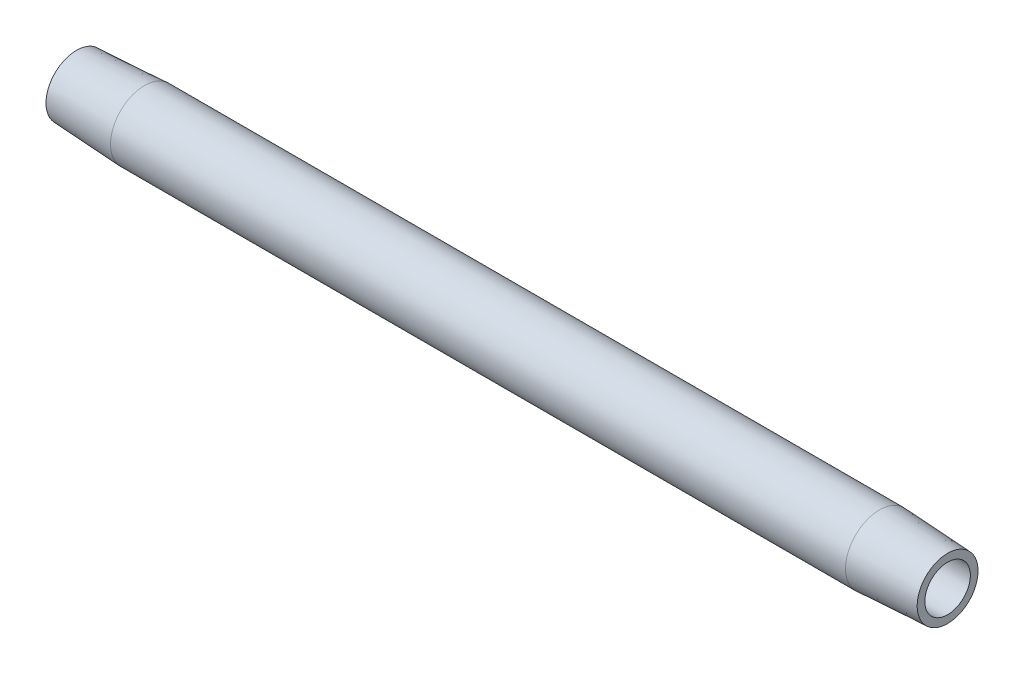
ISO-10303-21;
HEADER;
FILE_DESCRIPTION(('STEP AP214'),'2;1');
FILE_NAME('part.step','',(''),(''),'','','');
FILE_SCHEMA(('AUTOMOTIVE_DESIGN { 1 0 10303 214 1 1 1 1 }'));
ENDSEC;
DATA;
#1=APPLICATION_CONTEXT('core data for automotive mechanical design processes');
#2=APPLICATION_PROTOCOL_DEFINITION('international standard','automotive_design',2000,#1);
#3=PRODUCT_CONTEXT('',#1,'mechanical');
#4=PRODUCT('Part','Part','',(#3));
#5=PRODUCT_RELATED_PRODUCT_CATEGORY('part','',(#4));
#6=PRODUCT_DEFINITION_FORMATION('','',#4);
#7=PRODUCT_DEFINITION_CONTEXT('part definition',#1,'design');
#8=PRODUCT_DEFINITION('design','',#6,#7);
#9=PRODUCT_DEFINITION_SHAPE('','',#8);
#10=(LENGTH_UNIT() NAMED_UNIT(*) SI_UNIT(.MILLI.,.METRE.));
#11=(NAMED_UNIT(*) PLANE_ANGLE_UNIT() SI_UNIT($,.RADIAN.));
#12=(NAMED_UNIT(*) SI_UNIT($,.STERADIAN.) SOLID_ANGLE_UNIT());
#13=UNCERTAINTY_MEASURE_WITH_UNIT(LENGTH_MEASURE(1.E-05),#10,'distance_accuracy_value','');
#14=(GEOMETRIC_REPRESENTATION_CONTEXT(3) GLOBAL_UNCERTAINTY_ASSIGNED_CONTEXT((#13)) GLOBAL_UNIT_ASSIGNED_CONTEXT((#10,
#11,#12)) REPRESENTATION_CONTEXT('',''));
#15=CARTESIAN_POINT('',(0.,0.,0.));
#16=DIRECTION('',(0.,0.,1.));
#17=DIRECTION('',(1.,0.,0.));
#18=AXIS2_PLACEMENT_3D('',#15,#16,#17);
#19=CARTESIAN_POINT('',(0.476141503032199,0.,0.));
#20=DIRECTION('',(-1.,0.,0.));
#21=DIRECTION('',(0.,0.,1.));
#22=AXIS2_PLACEMENT_3D('',#19,#20,#21);
#23=CYLINDRICAL_SURFACE('',#22,3.96875);
#24=CARTESIAN_POINT('',(7.9375,0.,0.));
#25=DIRECTION('',(-1.,0.,0.));
#26=DIRECTION('',(0.,0.,1.));
#27=AXIS2_PLACEMENT_3D('',#24,#25,#26);
#28=CIRCLE('',#27,3.96875);
#29=CARTESIAN_POINT('',(7.9375,0.,3.96875));
#30=VERTEX_POINT('',#29);
#31=EDGE_CURVE('E10',#30,#30,#28,.T.);
#32=ORIENTED_EDGE('',*,*,#31,.F.);
#33=EDGE_LOOP('',(#32));
#34=FACE_BOUND('',#33,.T.);
#35=CARTESIAN_POINT('',(93.6625,0.,0.));
#36=DIRECTION('',(-1.,0.,0.));
#37=DIRECTION('',(0.,0.,1.));
#38=AXIS2_PLACEMENT_3D('',#35,#36,#37);
#39=CIRCLE('',#38,3.96875);
#40=CARTESIAN_POINT('',(93.6625,0.,3.96875));
#41=VERTEX_POINT('',#40);
#42=EDGE_CURVE('E52',#41,#41,#39,.T.);
#43=ORIENTED_EDGE('',*,*,#42,.T.);
#44=EDGE_LOOP('',(#43));
#45=FACE_BOUND('',#44,.T.);
#46=ADVANCED_FACE('F30',(#34,#45),#23,.T.);
#47=CARTESIAN_POINT('',(7.9375,0.,0.));
#48=DIRECTION('',(1.,0.,0.));
#49=DIRECTION('',(0.,0.,-1.));
#50=AXIS2_PLACEMENT_3D('',#47,#48,#49);
#51=CONICAL_SURFACE('',#50,3.96875,0.0523598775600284);
#52=CARTESIAN_POINT('',(0.,0.,0.));
#53=DIRECTION('',(-1.,0.,0.));
#54=DIRECTION('',(0.,0.,1.));
#55=AXIS2_PLACEMENT_3D('',#52,#53,#54);
#56=CIRCLE('',#55,3.55276325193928);
#57=CARTESIAN_POINT('',(0.,0.,3.55276325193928));
#58=VERTEX_POINT('',#57);
#59=EDGE_CURVE('E36',#58,#58,#56,.T.);
#60=ORIENTED_EDGE('',*,*,#59,.F.);
#61=EDGE_LOOP('',(#60));
#62=FACE_BOUND('',#61,.T.);
#63=ORIENTED_EDGE('',*,*,#31,.T.);
#64=EDGE_LOOP('',(#63));
#65=FACE_BOUND('',#64,.T.);
#66=ADVANCED_FACE('F77',(#62,#65),#51,.T.);
#67=CARTESIAN_POINT('',(0.,3.55276325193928,0.));
#68=DIRECTION('',(1.,0.,0.));
#69=DIRECTION('',(0.,0.,-1.));
#70=AXIS2_PLACEMENT_3D('',#67,#68,#69);
#71=PLANE('',#70);
#72=CARTESIAN_POINT('',(0.,0.,0.));
#73=DIRECTION('',(-1.,0.,0.));
#74=DIRECTION('',(0.,0.,1.));
#75=AXIS2_PLACEMENT_3D('',#72,#73,#74);
#76=CIRCLE('',#75,2.65429999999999);
#77=CARTESIAN_POINT('',(0.,0.,2.65429999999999));
#78=VERTEX_POINT('',#77);
#79=EDGE_CURVE('E40',#78,#78,#76,.T.);
#80=ORIENTED_EDGE('',*,*,#79,.F.);
#81=EDGE_LOOP('',(#80));
#82=FACE_BOUND('',#81,.T.);
#83=ORIENTED_EDGE('',*,*,#59,.T.);
#84=EDGE_LOOP('',(#83));
#85=FACE_BOUND('',#84,.T.);
#86=ADVANCED_FACE('F72',(#82,#85),#71,.F.);
#87=CARTESIAN_POINT('',(0.476141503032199,0.,0.));
#88=DIRECTION('',(-1.,0.,0.));
#89=DIRECTION('',(0.,0.,1.));
#90=AXIS2_PLACEMENT_3D('',#87,#88,#89);
#91=CYLINDRICAL_SURFACE('',#90,2.6543);
#92=CARTESIAN_POINT('',(101.6,0.,0.));
#93=DIRECTION('',(-1.,0.,0.));
#94=DIRECTION('',(0.,0.,1.));
#95=AXIS2_PLACEMENT_3D('',#92,#93,#94);
#96=CIRCLE('',#95,2.6543);
#97=CARTESIAN_POINT('',(101.6,0.,2.6543));
#98=VERTEX_POINT('',#97);
#99=EDGE_CURVE('E44',#98,#98,#96,.T.);
#100=ORIENTED_EDGE('',*,*,#99,.F.);
#101=EDGE_LOOP('',(#100));
#102=FACE_BOUND('',#101,.T.);
#103=ORIENTED_EDGE('',*,*,#79,.T.);
#104=EDGE_LOOP('',(#103));
#105=FACE_BOUND('',#104,.T.);
#106=ADVANCED_FACE('F66',(#102,#105),#91,.F.);
#107=CARTESIAN_POINT('',(101.6,2.6543,0.));
#108=DIRECTION('',(-1.,0.,0.));
#109=DIRECTION('',(0.,0.,1.));
#110=AXIS2_PLACEMENT_3D('',#107,#108,#109);
#111=PLANE('',#110);
#112=CARTESIAN_POINT('',(101.6,0.,0.));
#113=DIRECTION('',(-1.,0.,0.));
#114=DIRECTION('',(0.,0.,1.));
#115=AXIS2_PLACEMENT_3D('',#112,#113,#114);
#116=CIRCLE('',#115,3.55276325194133);
#117=CARTESIAN_POINT('',(101.6,0.,3.55276325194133));
#118=VERTEX_POINT('',#117);
#119=EDGE_CURVE('E49',#118,#118,#116,.T.);
#120=ORIENTED_EDGE('',*,*,#119,.F.);
#121=EDGE_LOOP('',(#120));
#122=FACE_BOUND('',#121,.T.);
#123=ORIENTED_EDGE('',*,*,#99,.T.);
#124=EDGE_LOOP('',(#123));
#125=FACE_BOUND('',#124,.T.);
#126=ADVANCED_FACE('F60',(#122,#125),#111,.F.);
#127=CARTESIAN_POINT('',(101.6,0.,0.));
#128=DIRECTION('',(-1.,0.,0.));
#129=DIRECTION('',(0.,0.,1.));
#130=AXIS2_PLACEMENT_3D('',#127,#128,#129);
#131=CONICAL_SURFACE('',#130,3.55276325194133,0.0523598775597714);
#132=ORIENTED_EDGE('',*,*,#42,.F.);
#133=EDGE_LOOP('',(#132));
#134=FACE_BOUND('',#133,.T.);
#135=ORIENTED_EDGE('',*,*,#119,.T.);
#136=EDGE_LOOP('',(#135));
#137=FACE_BOUND('',#136,.T.);
#138=ADVANCED_FACE('F57',(#134,#137),#131,.T.);
#139=CLOSED_SHELL('',(#46,#66,#86,#106,#126,#138));
#140=MANIFOLD_SOLID_BREP('B2',#139);
#141=ADVANCED_BREP_SHAPE_REPRESENTATION('',(#18,#140),#14);
#142=SHAPE_DEFINITION_REPRESENTATION(#9,#141);
ENDSEC;
END-ISO-10303-21;
